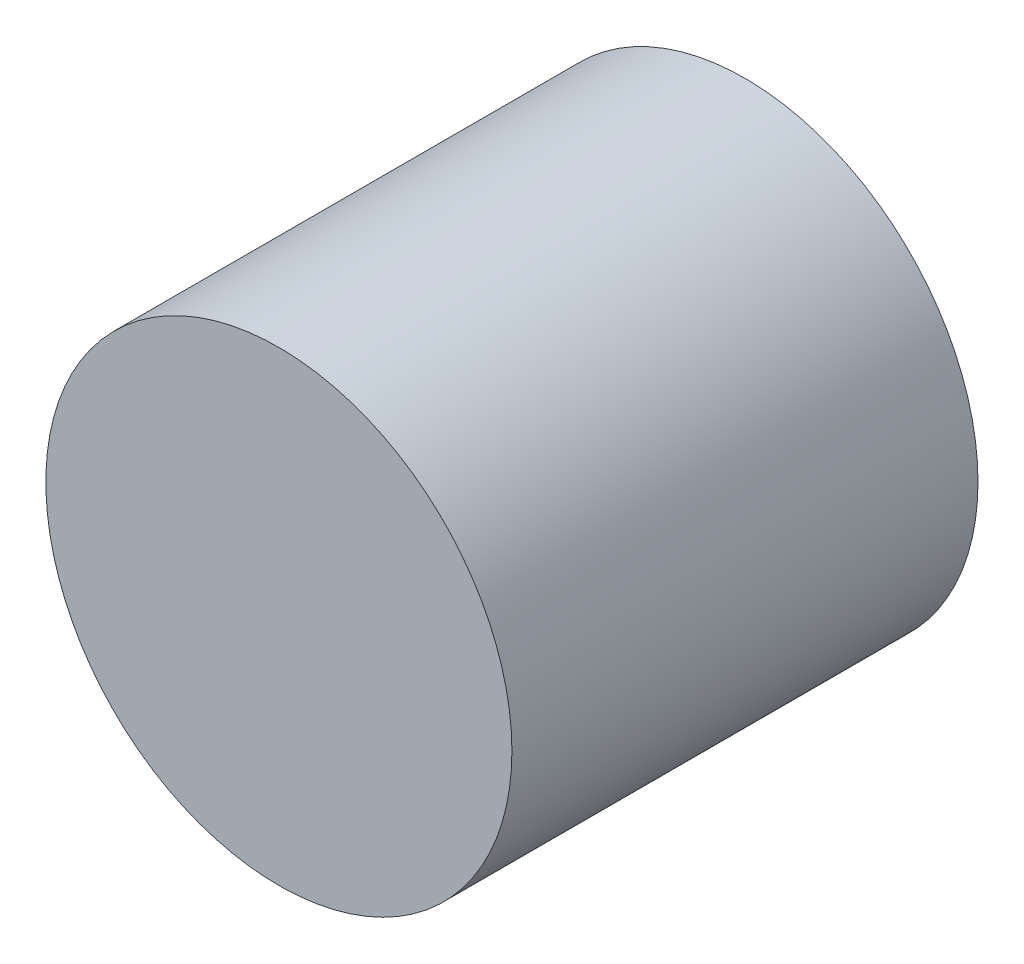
from build123d import *

# Parameters (mm, degrees)
SKIZZE1_R               = 2.5
LINEAR_AUSTRAGEN1_DEPTH = 5


with BuildPart() as part:
    # Skizze1 → Linear austragen1 (new body)
    with BuildSketch(Plane.XY):
        Circle(SKIZZE1_R)
    extrude(amount=LINEAR_AUSTRAGEN1_DEPTH)


solid = part.part
